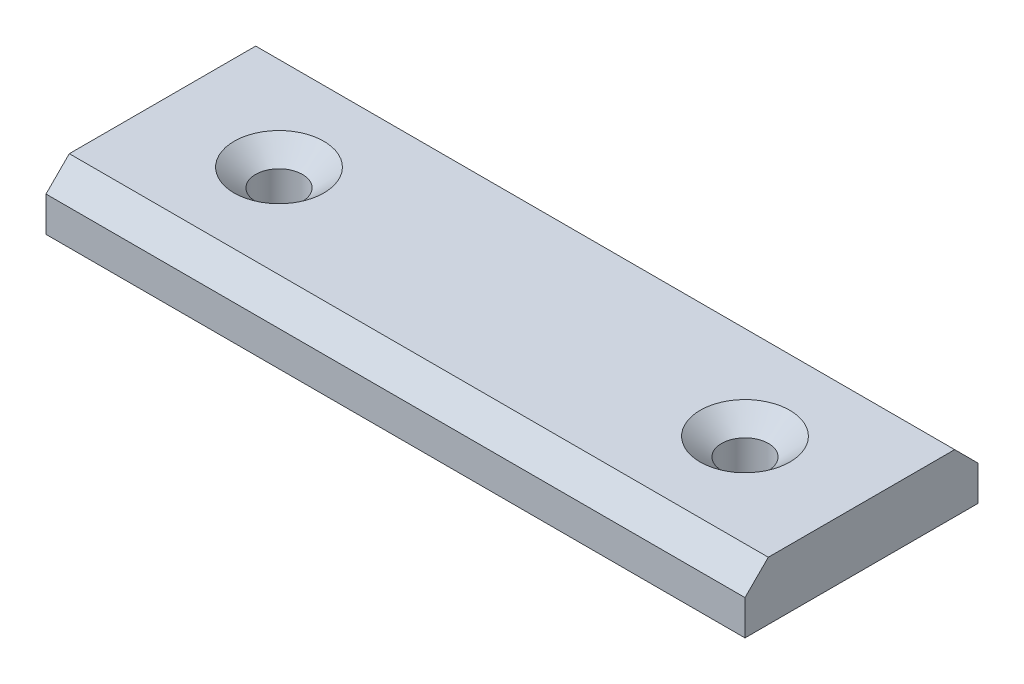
from build123d import *

# Parameters (mm, degrees)
SKETCH1_W                                          = 76.2
SKETCH1_H                                          = 25.4
EXTRUDE1_DEPTH                                     = 6.35
CSK_FOR_10_FLAT_HEAD_MACHINE_SCREW_100_D           = 5.1054
CSK_FOR_10_FLAT_HEAD_MACHINE_SCREW_100_CSINK_D     = 9.779
CSK_FOR_10_FLAT_HEAD_MACHINE_SCREW_100_CSINK_ANGLE = 100
CHAMFER1_SIZE                                      = 2.54


with BuildPart() as part:
    # Sketch1 → Extrude1 (new body)
    with BuildSketch(Plane(origin=(0, 0, 0), x_dir=(1, 0, 0), z_dir=(0, 1, 0))):
        with Locations((1.765827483, 29.78998628)):
            Rectangle(SKETCH1_W, SKETCH1_H)
    extrude(amount=EXTRUDE1_DEPTH)

    # CSK for _10 Flat Head Machine Screw _100 (through all)
    with Locations(Plane(origin=(-23.634172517, 6.35, -29.78998628), x_dir=(0, 0, 1), z_dir=(0, 1, 0))):
        with Locations((0, 0), (0, 50.8)):
            CounterSinkHole(CSK_FOR_10_FLAT_HEAD_MACHINE_SCREW_100_D / 2, CSK_FOR_10_FLAT_HEAD_MACHINE_SCREW_100_CSINK_D / 2, counter_sink_angle=CSK_FOR_10_FLAT_HEAD_MACHINE_SCREW_100_CSINK_ANGLE)

    # Chamfer1
    chamfer1_edges = [part.edges().sort_by_distance(p)[0] for p in [
        (1.765827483, 6.35, -42.48998628),
        (1.765827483, 6.35, -17.08998628),
    ]]
    chamfer(chamfer1_edges, length=CHAMFER1_SIZE)


solid = part.part
